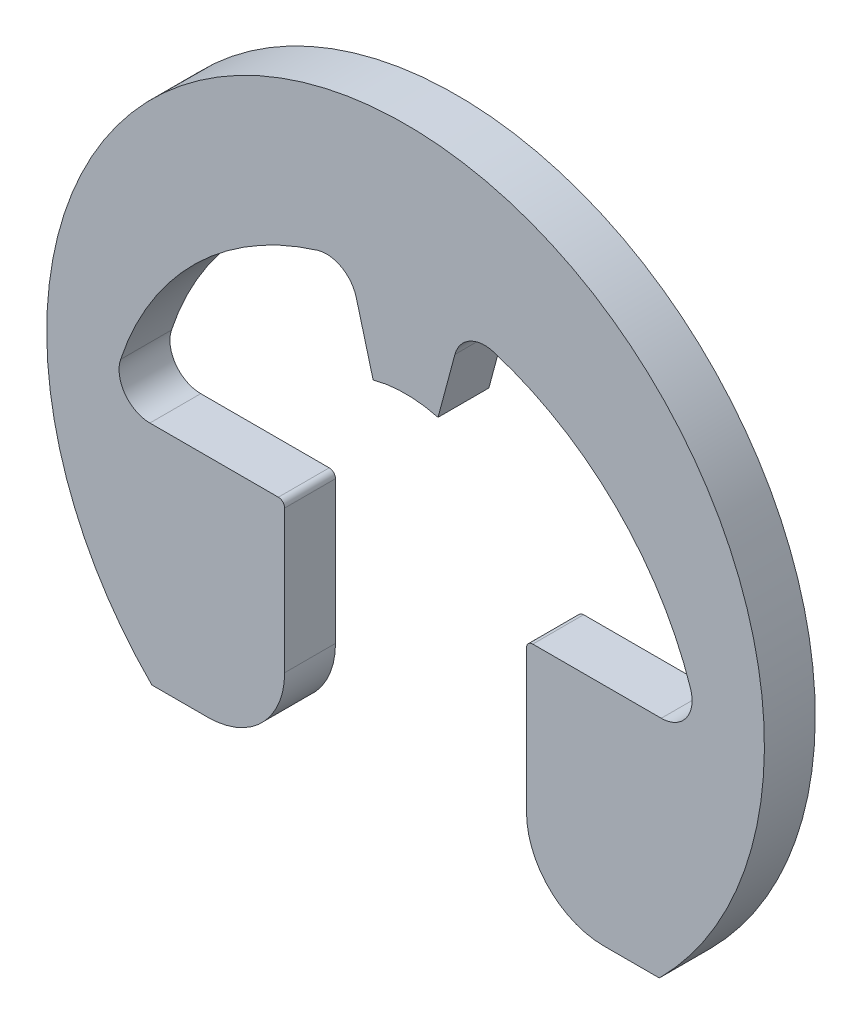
ISO-10303-21;
HEADER;
FILE_DESCRIPTION(('STEP AP214'),'2;1');
FILE_NAME('part.step','',(''),(''),'','','');
FILE_SCHEMA(('AUTOMOTIVE_DESIGN { 1 0 10303 214 1 1 1 1 }'));
ENDSEC;
DATA;
#1=APPLICATION_CONTEXT('core data for automotive mechanical design processes');
#2=APPLICATION_PROTOCOL_DEFINITION('international standard','automotive_design',2000,#1);
#3=PRODUCT_CONTEXT('',#1,'mechanical');
#4=PRODUCT('Part','Part','',(#3));
#5=PRODUCT_RELATED_PRODUCT_CATEGORY('part','',(#4));
#6=PRODUCT_DEFINITION_FORMATION('','',#4);
#7=PRODUCT_DEFINITION_CONTEXT('part definition',#1,'design');
#8=PRODUCT_DEFINITION('design','',#6,#7);
#9=PRODUCT_DEFINITION_SHAPE('','',#8);
#10=(LENGTH_UNIT() NAMED_UNIT(*) SI_UNIT(.MILLI.,.METRE.));
#11=(NAMED_UNIT(*) PLANE_ANGLE_UNIT() SI_UNIT($,.RADIAN.));
#12=(NAMED_UNIT(*) SI_UNIT($,.STERADIAN.) SOLID_ANGLE_UNIT());
#13=UNCERTAINTY_MEASURE_WITH_UNIT(LENGTH_MEASURE(1.E-05),#10,'distance_accuracy_value','');
#14=(GEOMETRIC_REPRESENTATION_CONTEXT(3) GLOBAL_UNCERTAINTY_ASSIGNED_CONTEXT((#13)) GLOBAL_UNIT_ASSIGNED_CONTEXT((#10,
#11,#12)) REPRESENTATION_CONTEXT('',''));
#15=CARTESIAN_POINT('',(0.,0.,0.));
#16=DIRECTION('',(0.,0.,1.));
#17=DIRECTION('',(1.,0.,0.));
#18=AXIS2_PLACEMENT_3D('',#15,#16,#17);
#19=CARTESIAN_POINT('',(-1.91596283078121,0.0224674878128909,-0.381));
#20=DIRECTION('',(0.,0.,1.));
#21=DIRECTION('',(1.,0.,0.));
#22=AXIS2_PLACEMENT_3D('',#19,#20,#21);
#23=CYLINDRICAL_SURFACE('',#22,0.230877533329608);
#24=CARTESIAN_POINT('',(-1.91596283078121,0.0224674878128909,0.));
#25=DIRECTION('',(0.,0.,-1.));
#26=DIRECTION('',(1.,0.,0.));
#27=AXIS2_PLACEMENT_3D('',#24,#25,#26);
#28=CIRCLE('',#27,0.230877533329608);
#29=CARTESIAN_POINT('',(-1.91596283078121,-0.208410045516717,0.));
#30=VERTEX_POINT('',#29);
#31=CARTESIAN_POINT('',(-2.13524840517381,0.0947050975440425,0.));
#32=VERTEX_POINT('',#31);
#33=EDGE_CURVE('E208',#30,#32,#28,.T.);
#34=ORIENTED_EDGE('',*,*,#33,.F.);
#35=DIRECTION('',(0.,0.,1.));
#36=VECTOR('',#35,1.);
#37=CARTESIAN_POINT('',(-1.91596283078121,-0.208410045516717,-0.381));
#38=LINE('',#37,#36);
#39=CARTESIAN_POINT('',(-1.91596283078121,-0.208410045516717,-0.381));
#40=VERTEX_POINT('',#39);
#41=EDGE_CURVE('E11',#40,#30,#38,.T.);
#42=ORIENTED_EDGE('',*,*,#41,.F.);
#43=CARTESIAN_POINT('',(-1.91596283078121,0.0224674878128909,-0.381));
#44=DIRECTION('',(0.,0.,-1.));
#45=DIRECTION('',(1.,0.,0.));
#46=AXIS2_PLACEMENT_3D('',#43,#44,#45);
#47=CIRCLE('',#46,0.230877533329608);
#48=CARTESIAN_POINT('',(-2.13524840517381,0.0947050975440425,-0.381));
#49=VERTEX_POINT('',#48);
#50=EDGE_CURVE('E264',#40,#49,#47,.T.);
#51=ORIENTED_EDGE('',*,*,#50,.T.);
#52=DIRECTION('',(0.,0.,1.));
#53=VECTOR('',#52,1.);
#54=CARTESIAN_POINT('',(-2.13524840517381,0.0947050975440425,-0.381));
#55=LINE('',#54,#53);
#56=EDGE_CURVE('E42',#49,#32,#55,.T.);
#57=ORIENTED_EDGE('',*,*,#56,.T.);
#58=EDGE_LOOP('',(#34,#42,#51,#57));
#59=FACE_BOUND('',#58,.T.);
#60=ADVANCED_FACE('F39',(#59),#23,.F.);
#61=CARTESIAN_POINT('',(-0.953165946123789,-0.208410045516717,-0.381));
#62=DIRECTION('',(0.,1.,0.));
#63=DIRECTION('',(-1.,0.,0.));
#64=AXIS2_PLACEMENT_3D('',#61,#62,#63);
#65=PLANE('',#64);
#66=DIRECTION('',(-1.,0.,0.));
#67=VECTOR('',#66,1.);
#68=CARTESIAN_POINT('',(-0.953165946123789,-0.208410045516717,0.));
#69=LINE('',#68,#67);
#70=CARTESIAN_POINT('',(-0.953165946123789,-0.208410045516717,0.));
#71=VERTEX_POINT('',#70);
#72=EDGE_CURVE('E262',#71,#30,#69,.T.);
#73=ORIENTED_EDGE('',*,*,#72,.F.);
#74=DIRECTION('',(0.,0.,1.));
#75=VECTOR('',#74,1.);
#76=CARTESIAN_POINT('',(-0.953165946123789,-0.208410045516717,-0.381));
#77=LINE('',#76,#75);
#78=CARTESIAN_POINT('',(-0.953165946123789,-0.208410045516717,-0.381));
#79=VERTEX_POINT('',#78);
#80=EDGE_CURVE('E48',#79,#71,#77,.T.);
#81=ORIENTED_EDGE('',*,*,#80,.F.);
#82=DIRECTION('',(-1.,0.,0.));
#83=VECTOR('',#82,1.);
#84=CARTESIAN_POINT('',(-0.953165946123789,-0.208410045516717,-0.381));
#85=LINE('',#84,#83);
#86=EDGE_CURVE('E198',#79,#40,#85,.T.);
#87=ORIENTED_EDGE('',*,*,#86,.T.);
#88=ORIENTED_EDGE('',*,*,#41,.T.);
#89=EDGE_LOOP('',(#73,#81,#87,#88));
#90=FACE_BOUND('',#89,.T.);
#91=ADVANCED_FACE('F300',(#90),#65,.T.);
#92=CARTESIAN_POINT('',(-0.953165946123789,-0.255400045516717,-0.381));
#93=DIRECTION('',(0.,0.,1.));
#94=DIRECTION('',(1.,0.,0.));
#95=AXIS2_PLACEMENT_3D('',#92,#93,#94);
#96=CYLINDRICAL_SURFACE('',#95,0.0469900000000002);
#97=CARTESIAN_POINT('',(-0.953165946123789,-0.255400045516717,0.));
#98=DIRECTION('',(0.,0.,1.));
#99=DIRECTION('',(1.,0.,0.));
#100=AXIS2_PLACEMENT_3D('',#97,#98,#99);
#101=CIRCLE('',#100,0.0469900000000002);
#102=CARTESIAN_POINT('',(-0.906175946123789,-0.255400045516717,0.));
#103=VERTEX_POINT('',#102);
#104=EDGE_CURVE('E185',#103,#71,#101,.T.);
#105=ORIENTED_EDGE('',*,*,#104,.F.);
#106=DIRECTION('',(0.,0.,1.));
#107=VECTOR('',#106,1.);
#108=CARTESIAN_POINT('',(-0.906175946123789,-0.255400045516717,-0.381));
#109=LINE('',#108,#107);
#110=CARTESIAN_POINT('',(-0.906175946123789,-0.255400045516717,-0.381));
#111=VERTEX_POINT('',#110);
#112=EDGE_CURVE('E180',#111,#103,#109,.T.);
#113=ORIENTED_EDGE('',*,*,#112,.F.);
#114=CARTESIAN_POINT('',(-0.953165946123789,-0.255400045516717,-0.381));
#115=DIRECTION('',(0.,0.,1.));
#116=DIRECTION('',(1.,0.,0.));
#117=AXIS2_PLACEMENT_3D('',#114,#115,#116);
#118=CIRCLE('',#117,0.0469900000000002);
#119=EDGE_CURVE('E183',#111,#79,#118,.T.);
#120=ORIENTED_EDGE('',*,*,#119,.T.);
#121=ORIENTED_EDGE('',*,*,#80,.T.);
#122=EDGE_LOOP('',(#105,#113,#120,#121));
#123=FACE_BOUND('',#122,.T.);
#124=ADVANCED_FACE('F182',(#123),#96,.T.);
#125=CARTESIAN_POINT('',(-0.906175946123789,-0.255400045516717,-0.381));
#126=DIRECTION('',(1.,0.,0.));
#127=DIRECTION('',(0.,1.,0.));
#128=AXIS2_PLACEMENT_3D('',#125,#126,#127);
#129=PLANE('',#128);
#130=DIRECTION('',(0.,1.,0.));
#131=VECTOR('',#130,1.);
#132=CARTESIAN_POINT('',(-0.906175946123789,-0.255400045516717,0.));
#133=LINE('',#132,#131);
#134=CARTESIAN_POINT('',(-0.906175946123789,-1.32412594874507,0.));
#135=VERTEX_POINT('',#134);
#136=EDGE_CURVE('E259',#135,#103,#133,.T.);
#137=ORIENTED_EDGE('',*,*,#136,.F.);
#138=DIRECTION('',(0.,0.,1.));
#139=VECTOR('',#138,1.);
#140=CARTESIAN_POINT('',(-0.906175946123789,-1.32412594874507,-0.381));
#141=LINE('',#140,#139);
#142=CARTESIAN_POINT('',(-0.906175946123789,-1.32412594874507,-0.381));
#143=VERTEX_POINT('',#142);
#144=EDGE_CURVE('E190',#143,#135,#141,.T.);
#145=ORIENTED_EDGE('',*,*,#144,.F.);
#146=DIRECTION('',(0.,1.,0.));
#147=VECTOR('',#146,1.);
#148=CARTESIAN_POINT('',(-0.906175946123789,-0.255400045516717,-0.381));
#149=LINE('',#148,#147);
#150=EDGE_CURVE('E196',#143,#111,#149,.T.);
#151=ORIENTED_EDGE('',*,*,#150,.T.);
#152=ORIENTED_EDGE('',*,*,#112,.T.);
#153=EDGE_LOOP('',(#137,#145,#151,#152));
#154=FACE_BOUND('',#153,.T.);
#155=ADVANCED_FACE('F200',(#154),#129,.T.);
#156=CARTESIAN_POINT('',(-1.48336977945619,-1.32412594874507,-0.381));
#157=DIRECTION('',(0.,0.,1.));
#158=DIRECTION('',(1.,0.,0.));
#159=AXIS2_PLACEMENT_3D('',#156,#157,#158);
#160=CYLINDRICAL_SURFACE('',#159,0.577193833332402);
#161=CARTESIAN_POINT('',(-1.48336977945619,-1.32412594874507,0.));
#162=DIRECTION('',(0.,0.,1.));
#163=DIRECTION('',(1.,0.,0.));
#164=AXIS2_PLACEMENT_3D('',#161,#162,#163);
#165=CIRCLE('',#164,0.577193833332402);
#166=CARTESIAN_POINT('',(-1.48336977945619,-1.90131978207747,0.));
#167=VERTEX_POINT('',#166);
#168=EDGE_CURVE('E256',#167,#135,#165,.T.);
#169=ORIENTED_EDGE('',*,*,#168,.F.);
#170=DIRECTION('',(0.,0.,1.));
#171=VECTOR('',#170,1.);
#172=CARTESIAN_POINT('',(-1.48336977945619,-1.90131978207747,-0.381));
#173=LINE('',#172,#171);
#174=CARTESIAN_POINT('',(-1.48336977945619,-1.90131978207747,-0.381));
#175=VERTEX_POINT('',#174);
#176=EDGE_CURVE('E268',#175,#167,#173,.T.);
#177=ORIENTED_EDGE('',*,*,#176,.F.);
#178=CARTESIAN_POINT('',(-1.48336977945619,-1.32412594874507,-0.381));
#179=DIRECTION('',(0.,0.,1.));
#180=DIRECTION('',(1.,0.,0.));
#181=AXIS2_PLACEMENT_3D('',#178,#179,#180);
#182=CIRCLE('',#181,0.577193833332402);
#183=EDGE_CURVE('E201',#175,#143,#182,.T.);
#184=ORIENTED_EDGE('',*,*,#183,.T.);
#185=ORIENTED_EDGE('',*,*,#144,.T.);
#186=EDGE_LOOP('',(#169,#177,#184,#185));
#187=FACE_BOUND('',#186,.T.);
#188=ADVANCED_FACE('F313',(#187),#160,.T.);
#189=CARTESIAN_POINT('',(-1.48336977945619,-1.90131978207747,-0.381));
#190=DIRECTION('',(0.,-1.,0.));
#191=DIRECTION('',(1.,0.,0.));
#192=AXIS2_PLACEMENT_3D('',#189,#190,#191);
#193=PLANE('',#192);
#194=DIRECTION('',(1.,0.,0.));
#195=VECTOR('',#194,1.);
#196=CARTESIAN_POINT('',(-1.48336977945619,-1.90131978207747,0.));
#197=LINE('',#196,#195);
#198=CARTESIAN_POINT('',(-1.90131978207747,-1.90131978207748,0.));
#199=VERTEX_POINT('',#198);
#200=EDGE_CURVE('E253',#199,#167,#197,.T.);
#201=ORIENTED_EDGE('',*,*,#200,.F.);
#202=DIRECTION('',(0.,0.,1.));
#203=VECTOR('',#202,1.);
#204=CARTESIAN_POINT('',(-1.90131978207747,-1.90131978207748,-0.381));
#205=LINE('',#204,#203);
#206=CARTESIAN_POINT('',(-1.90131978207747,-1.90131978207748,-0.381));
#207=VERTEX_POINT('',#206);
#208=EDGE_CURVE('E270',#207,#199,#205,.T.);
#209=ORIENTED_EDGE('',*,*,#208,.F.);
#210=DIRECTION('',(1.,0.,0.));
#211=VECTOR('',#210,1.);
#212=CARTESIAN_POINT('',(-1.48336977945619,-1.90131978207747,-0.381));
#213=LINE('',#212,#211);
#214=EDGE_CURVE('E203',#207,#175,#213,.T.);
#215=ORIENTED_EDGE('',*,*,#214,.T.);
#216=ORIENTED_EDGE('',*,*,#176,.T.);
#217=EDGE_LOOP('',(#201,#209,#215,#216));
#218=FACE_BOUND('',#217,.T.);
#219=ADVANCED_FACE('F316',(#218),#193,.T.);
#220=CARTESIAN_POINT('',(0.,0.,-0.381));
#221=DIRECTION('',(0.,0.,1.));
#222=DIRECTION('',(1.,0.,0.));
#223=AXIS2_PLACEMENT_3D('',#220,#221,#222);
#224=CYLINDRICAL_SURFACE('',#223,2.68887222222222);
#225=CARTESIAN_POINT('',(0.,0.,0.));
#226=DIRECTION('',(0.,0.,1.));
#227=DIRECTION('',(1.,0.,0.));
#228=AXIS2_PLACEMENT_3D('',#225,#226,#227);
#229=CIRCLE('',#228,2.68887222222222);
#230=CARTESIAN_POINT('',(1.90131978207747,-1.90131978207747,0.));
#231=VERTEX_POINT('',#230);
#232=EDGE_CURVE('E250',#231,#199,#229,.T.);
#233=ORIENTED_EDGE('',*,*,#232,.F.);
#234=DIRECTION('',(0.,0.,1.));
#235=VECTOR('',#234,1.);
#236=CARTESIAN_POINT('',(1.90131978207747,-1.90131978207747,-0.381));
#237=LINE('',#236,#235);
#238=CARTESIAN_POINT('',(1.90131978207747,-1.90131978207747,-0.381));
#239=VERTEX_POINT('',#238);
#240=EDGE_CURVE('E272',#239,#231,#237,.T.);
#241=ORIENTED_EDGE('',*,*,#240,.F.);
#242=CARTESIAN_POINT('',(0.,0.,-0.381));
#243=DIRECTION('',(0.,0.,1.));
#244=DIRECTION('',(1.,0.,0.));
#245=AXIS2_PLACEMENT_3D('',#242,#243,#244);
#246=CIRCLE('',#245,2.68887222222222);
#247=EDGE_CURVE('E555',#239,#207,#246,.T.);
#248=ORIENTED_EDGE('',*,*,#247,.T.);
#249=ORIENTED_EDGE('',*,*,#208,.T.);
#250=EDGE_LOOP('',(#233,#241,#248,#249));
#251=FACE_BOUND('',#250,.T.);
#252=ADVANCED_FACE('F320',(#251),#224,.T.);
#253=CARTESIAN_POINT('',(1.90131978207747,-1.90131978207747,-0.381));
#254=DIRECTION('',(0.,-1.,0.));
#255=DIRECTION('',(0.,0.,-1.));
#256=AXIS2_PLACEMENT_3D('',#253,#254,#255);
#257=PLANE('',#256);
#258=DIRECTION('',(1.,0.,0.));
#259=VECTOR('',#258,1.);
#260=CARTESIAN_POINT('',(1.90131978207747,-1.90131978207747,0.));
#261=LINE('',#260,#259);
#262=CARTESIAN_POINT('',(1.48336977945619,-1.90131978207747,0.));
#263=VERTEX_POINT('',#262);
#264=EDGE_CURVE('E247',#263,#231,#261,.T.);
#265=ORIENTED_EDGE('',*,*,#264,.F.);
#266=DIRECTION('',(0.,0.,1.));
#267=VECTOR('',#266,1.);
#268=CARTESIAN_POINT('',(1.48336977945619,-1.90131978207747,-0.381));
#269=LINE('',#268,#267);
#270=CARTESIAN_POINT('',(1.48336977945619,-1.90131978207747,-0.381));
#271=VERTEX_POINT('',#270);
#272=EDGE_CURVE('E274',#271,#263,#269,.T.);
#273=ORIENTED_EDGE('',*,*,#272,.F.);
#274=DIRECTION('',(1.,0.,0.));
#275=VECTOR('',#274,1.);
#276=CARTESIAN_POINT('',(1.90131978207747,-1.90131978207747,-0.381));
#277=LINE('',#276,#275);
#278=EDGE_CURVE('E548',#271,#239,#277,.T.);
#279=ORIENTED_EDGE('',*,*,#278,.T.);
#280=ORIENTED_EDGE('',*,*,#240,.T.);
#281=EDGE_LOOP('',(#265,#273,#279,#280));
#282=FACE_BOUND('',#281,.T.);
#283=ADVANCED_FACE('F324',(#282),#257,.T.);
#284=CARTESIAN_POINT('',(1.48336977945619,-1.32412594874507,-0.381));
#285=DIRECTION('',(0.,0.,1.));
#286=DIRECTION('',(1.,0.,0.));
#287=AXIS2_PLACEMENT_3D('',#284,#285,#286);
#288=CYLINDRICAL_SURFACE('',#287,0.577193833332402);
#289=CARTESIAN_POINT('',(1.48336977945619,-1.32412594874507,0.));
#290=DIRECTION('',(0.,0.,1.));
#291=DIRECTION('',(1.,0.,0.));
#292=AXIS2_PLACEMENT_3D('',#289,#290,#291);
#293=CIRCLE('',#292,0.577193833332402);
#294=CARTESIAN_POINT('',(0.90617594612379,-1.32412594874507,0.));
#295=VERTEX_POINT('',#294);
#296=EDGE_CURVE('E244',#295,#263,#293,.T.);
#297=ORIENTED_EDGE('',*,*,#296,.F.);
#298=DIRECTION('',(0.,0.,1.));
#299=VECTOR('',#298,1.);
#300=CARTESIAN_POINT('',(0.90617594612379,-1.32412594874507,-0.381));
#301=LINE('',#300,#299);
#302=CARTESIAN_POINT('',(0.90617594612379,-1.32412594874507,-0.381));
#303=VERTEX_POINT('',#302);
#304=EDGE_CURVE('E276',#303,#295,#301,.T.);
#305=ORIENTED_EDGE('',*,*,#304,.F.);
#306=CARTESIAN_POINT('',(1.48336977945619,-1.32412594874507,-0.381));
#307=DIRECTION('',(0.,0.,1.));
#308=DIRECTION('',(1.,0.,0.));
#309=AXIS2_PLACEMENT_3D('',#306,#307,#308);
#310=CIRCLE('',#309,0.577193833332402);
#311=EDGE_CURVE('E544',#303,#271,#310,.T.);
#312=ORIENTED_EDGE('',*,*,#311,.T.);
#313=ORIENTED_EDGE('',*,*,#272,.T.);
#314=EDGE_LOOP('',(#297,#305,#312,#313));
#315=FACE_BOUND('',#314,.T.);
#316=ADVANCED_FACE('F328',(#315),#288,.T.);
#317=CARTESIAN_POINT('',(0.906175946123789,-0.255400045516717,-0.381));
#318=DIRECTION('',(-1.,0.,0.));
#319=DIRECTION('',(0.,-1.,0.));
#320=AXIS2_PLACEMENT_3D('',#317,#318,#319);
#321=PLANE('',#320);
#322=DIRECTION('',(0.,-1.,0.));
#323=VECTOR('',#322,1.);
#324=CARTESIAN_POINT('',(0.906175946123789,-0.255400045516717,0.));
#325=LINE('',#324,#323);
#326=CARTESIAN_POINT('',(0.906175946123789,-0.255400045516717,0.));
#327=VERTEX_POINT('',#326);
#328=EDGE_CURVE('E241',#327,#295,#325,.T.);
#329=ORIENTED_EDGE('',*,*,#328,.F.);
#330=DIRECTION('',(0.,0.,1.));
#331=VECTOR('',#330,1.);
#332=CARTESIAN_POINT('',(0.906175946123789,-0.255400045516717,-0.381));
#333=LINE('',#332,#331);
#334=CARTESIAN_POINT('',(0.906175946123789,-0.255400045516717,-0.381));
#335=VERTEX_POINT('',#334);
#336=EDGE_CURVE('E278',#335,#327,#333,.T.);
#337=ORIENTED_EDGE('',*,*,#336,.F.);
#338=DIRECTION('',(0.,-1.,0.));
#339=VECTOR('',#338,1.);
#340=CARTESIAN_POINT('',(0.906175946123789,-0.255400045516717,-0.381));
#341=LINE('',#340,#339);
#342=EDGE_CURVE('E560',#335,#303,#341,.T.);
#343=ORIENTED_EDGE('',*,*,#342,.T.);
#344=ORIENTED_EDGE('',*,*,#304,.T.);
#345=EDGE_LOOP('',(#329,#337,#343,#344));
#346=FACE_BOUND('',#345,.T.);
#347=ADVANCED_FACE('F332',(#346),#321,.T.);
#348=CARTESIAN_POINT('',(0.953165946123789,-0.255400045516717,-0.381));
#349=DIRECTION('',(0.,0.,1.));
#350=DIRECTION('',(1.,0.,0.));
#351=AXIS2_PLACEMENT_3D('',#348,#349,#350);
#352=CYLINDRICAL_SURFACE('',#351,0.0469900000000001);
#353=CARTESIAN_POINT('',(0.953165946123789,-0.255400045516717,0.));
#354=DIRECTION('',(0.,0.,1.));
#355=DIRECTION('',(1.,0.,0.));
#356=AXIS2_PLACEMENT_3D('',#353,#354,#355);
#357=CIRCLE('',#356,0.0469900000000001);
#358=CARTESIAN_POINT('',(0.953165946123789,-0.208410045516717,0.));
#359=VERTEX_POINT('',#358);
#360=EDGE_CURVE('E238',#359,#327,#357,.T.);
#361=ORIENTED_EDGE('',*,*,#360,.F.);
#362=DIRECTION('',(0.,0.,1.));
#363=VECTOR('',#362,1.);
#364=CARTESIAN_POINT('',(0.953165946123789,-0.208410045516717,-0.381));
#365=LINE('',#364,#363);
#366=CARTESIAN_POINT('',(0.953165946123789,-0.208410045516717,-0.381));
#367=VERTEX_POINT('',#366);
#368=EDGE_CURVE('E280',#367,#359,#365,.T.);
#369=ORIENTED_EDGE('',*,*,#368,.F.);
#370=CARTESIAN_POINT('',(0.953165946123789,-0.255400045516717,-0.381));
#371=DIRECTION('',(0.,0.,1.));
#372=DIRECTION('',(1.,0.,0.));
#373=AXIS2_PLACEMENT_3D('',#370,#371,#372);
#374=CIRCLE('',#373,0.0469900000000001);
#375=EDGE_CURVE('E537',#367,#335,#374,.T.);
#376=ORIENTED_EDGE('',*,*,#375,.T.);
#377=ORIENTED_EDGE('',*,*,#336,.T.);
#378=EDGE_LOOP('',(#361,#369,#376,#377));
#379=FACE_BOUND('',#378,.T.);
#380=ADVANCED_FACE('F336',(#379),#352,.T.);
#381=CARTESIAN_POINT('',(0.953165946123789,-0.208410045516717,-0.381));
#382=DIRECTION('',(0.,1.,0.));
#383=DIRECTION('',(-1.,0.,0.));
#384=AXIS2_PLACEMENT_3D('',#381,#382,#383);
#385=PLANE('',#384);
#386=DIRECTION('',(-1.,0.,0.));
#387=VECTOR('',#386,1.);
#388=CARTESIAN_POINT('',(0.953165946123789,-0.208410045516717,0.));
#389=LINE('',#388,#387);
#390=CARTESIAN_POINT('',(1.91596283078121,-0.208410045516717,0.));
#391=VERTEX_POINT('',#390);
#392=EDGE_CURVE('E235',#391,#359,#389,.T.);
#393=ORIENTED_EDGE('',*,*,#392,.F.);
#394=DIRECTION('',(0.,0.,1.));
#395=VECTOR('',#394,1.);
#396=CARTESIAN_POINT('',(1.91596283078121,-0.208410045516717,-0.381));
#397=LINE('',#396,#395);
#398=CARTESIAN_POINT('',(1.91596283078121,-0.208410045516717,-0.381));
#399=VERTEX_POINT('',#398);
#400=EDGE_CURVE('E282',#399,#391,#397,.T.);
#401=ORIENTED_EDGE('',*,*,#400,.F.);
#402=DIRECTION('',(-1.,0.,0.));
#403=VECTOR('',#402,1.);
#404=CARTESIAN_POINT('',(0.953165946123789,-0.208410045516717,-0.381));
#405=LINE('',#404,#403);
#406=EDGE_CURVE('E533',#399,#367,#405,.T.);
#407=ORIENTED_EDGE('',*,*,#406,.T.);
#408=ORIENTED_EDGE('',*,*,#368,.T.);
#409=EDGE_LOOP('',(#393,#401,#407,#408));
#410=FACE_BOUND('',#409,.T.);
#411=ADVANCED_FACE('F340',(#410),#385,.T.);
#412=CARTESIAN_POINT('',(1.91596283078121,0.0224674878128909,-0.381));
#413=DIRECTION('',(0.,0.,1.));
#414=DIRECTION('',(1.,0.,0.));
#415=AXIS2_PLACEMENT_3D('',#412,#413,#414);
#416=CYLINDRICAL_SURFACE('',#415,0.230877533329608);
#417=CARTESIAN_POINT('',(1.91596283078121,0.0224674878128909,0.));
#418=DIRECTION('',(0.,0.,-1.));
#419=DIRECTION('',(1.,0.,0.));
#420=AXIS2_PLACEMENT_3D('',#417,#418,#419);
#421=CIRCLE('',#420,0.230877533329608);
#422=CARTESIAN_POINT('',(2.13524840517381,0.0947050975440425,0.));
#423=VERTEX_POINT('',#422);
#424=EDGE_CURVE('E232',#423,#391,#421,.T.);
#425=ORIENTED_EDGE('',*,*,#424,.F.);
#426=DIRECTION('',(0.,0.,1.));
#427=VECTOR('',#426,1.);
#428=CARTESIAN_POINT('',(2.13524840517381,0.0947050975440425,-0.381));
#429=LINE('',#428,#427);
#430=CARTESIAN_POINT('',(2.13524840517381,0.0947050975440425,-0.381));
#431=VERTEX_POINT('',#430);
#432=EDGE_CURVE('E284',#431,#423,#429,.T.);
#433=ORIENTED_EDGE('',*,*,#432,.F.);
#434=CARTESIAN_POINT('',(1.91596283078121,0.0224674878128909,-0.381));
#435=DIRECTION('',(0.,0.,-1.));
#436=DIRECTION('',(1.,0.,0.));
#437=AXIS2_PLACEMENT_3D('',#434,#435,#436);
#438=CIRCLE('',#437,0.230877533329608);
#439=EDGE_CURVE('E564',#431,#399,#438,.T.);
#440=ORIENTED_EDGE('',*,*,#439,.T.);
#441=ORIENTED_EDGE('',*,*,#400,.T.);
#442=EDGE_LOOP('',(#425,#433,#440,#441));
#443=FACE_BOUND('',#442,.T.);
#444=ADVANCED_FACE('F344',(#443),#416,.F.);
#445=CARTESIAN_POINT('',(0.,-0.608693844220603,-0.381));
#446=DIRECTION('',(0.,0.,1.));
#447=DIRECTION('',(1.,0.,0.));
#448=AXIS2_PLACEMENT_3D('',#445,#446,#447);
#449=CYLINDRICAL_SURFACE('',#448,2.2481227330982);
#450=CARTESIAN_POINT('',(0.,-0.608693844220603,0.));
#451=DIRECTION('',(0.,0.,-1.));
#452=DIRECTION('',(-1.,0.,0.));
#453=AXIS2_PLACEMENT_3D('',#450,#451,#452);
#454=CIRCLE('',#453,2.2481227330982);
#455=CARTESIAN_POINT('',(0.66041689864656,1.54023736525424,0.));
#456=VERTEX_POINT('',#455);
#457=EDGE_CURVE('E229',#456,#423,#454,.T.);
#458=ORIENTED_EDGE('',*,*,#457,.F.);
#459=DIRECTION('',(0.,0.,1.));
#460=VECTOR('',#459,1.);
#461=CARTESIAN_POINT('',(0.66041689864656,1.54023736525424,-0.381));
#462=LINE('',#461,#460);
#463=CARTESIAN_POINT('',(0.66041689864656,1.54023736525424,-0.381));
#464=VERTEX_POINT('',#463);
#465=EDGE_CURVE('E286',#464,#456,#462,.T.);
#466=ORIENTED_EDGE('',*,*,#465,.F.);
#467=CARTESIAN_POINT('',(0.,-0.608693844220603,-0.381));
#468=DIRECTION('',(0.,0.,-1.));
#469=DIRECTION('',(-1.,0.,0.));
#470=AXIS2_PLACEMENT_3D('',#467,#468,#469);
#471=CIRCLE('',#470,2.2481227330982);
#472=EDGE_CURVE('E526',#464,#431,#471,.T.);
#473=ORIENTED_EDGE('',*,*,#472,.T.);
#474=ORIENTED_EDGE('',*,*,#432,.T.);
#475=EDGE_LOOP('',(#458,#466,#473,#474));
#476=FACE_BOUND('',#475,.T.);
#477=ADVANCED_FACE('F348',(#476),#449,.F.);
#478=CARTESIAN_POINT('',(0.592593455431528,1.31954659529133,-0.381));
#479=DIRECTION('',(0.,0.,1.));
#480=DIRECTION('',(1.,0.,0.));
#481=AXIS2_PLACEMENT_3D('',#478,#479,#480);
#482=CYLINDRICAL_SURFACE('',#481,0.230877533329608);
#483=CARTESIAN_POINT('',(0.592593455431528,1.31954659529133,0.));
#484=DIRECTION('',(0.,0.,-1.));
#485=DIRECTION('',(1.,0.,0.));
#486=AXIS2_PLACEMENT_3D('',#483,#484,#485);
#487=CIRCLE('',#486,0.230877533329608);
#488=CARTESIAN_POINT('',(0.369582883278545,1.37930209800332,0.));
#489=VERTEX_POINT('',#488);
#490=EDGE_CURVE('E226',#489,#456,#487,.T.);
#491=ORIENTED_EDGE('',*,*,#490,.F.);
#492=DIRECTION('',(0.,0.,1.));
#493=VECTOR('',#492,1.);
#494=CARTESIAN_POINT('',(0.369582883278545,1.37930209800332,-0.381));
#495=LINE('',#494,#493);
#496=CARTESIAN_POINT('',(0.369582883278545,1.37930209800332,-0.381));
#497=VERTEX_POINT('',#496);
#498=EDGE_CURVE('E288',#497,#489,#495,.T.);
#499=ORIENTED_EDGE('',*,*,#498,.F.);
#500=CARTESIAN_POINT('',(0.592593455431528,1.31954659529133,-0.381));
#501=DIRECTION('',(0.,0.,-1.));
#502=DIRECTION('',(1.,0.,0.));
#503=AXIS2_PLACEMENT_3D('',#500,#501,#502);
#504=CIRCLE('',#503,0.230877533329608);
#505=EDGE_CURVE('E522',#497,#464,#504,.T.);
#506=ORIENTED_EDGE('',*,*,#505,.T.);
#507=ORIENTED_EDGE('',*,*,#465,.T.);
#508=EDGE_LOOP('',(#491,#499,#506,#507));
#509=FACE_BOUND('',#508,.T.);
#510=ADVANCED_FACE('F352',(#509),#482,.F.);
#511=CARTESIAN_POINT('',(0.369582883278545,1.37930209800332,-0.381));
#512=DIRECTION('',(0.965925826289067,-0.258819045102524,0.));
#513=DIRECTION('',(0.258819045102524,0.965925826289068,0.));
#514=AXIS2_PLACEMENT_3D('',#511,#512,#513);
#515=PLANE('',#514);
#516=DIRECTION('',(0.258819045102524,0.965925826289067,0.));
#517=VECTOR('',#516,1.);
#518=CARTESIAN_POINT('',(0.369582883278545,1.37930209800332,0.));
#519=LINE('',#518,#517);
#520=CARTESIAN_POINT('',(0.243238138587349,0.907777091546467,0.));
#521=VERTEX_POINT('',#520);
#522=EDGE_CURVE('E223',#521,#489,#519,.T.);
#523=ORIENTED_EDGE('',*,*,#522,.F.);
#524=DIRECTION('',(0.,0.,1.));
#525=VECTOR('',#524,1.);
#526=CARTESIAN_POINT('',(0.243238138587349,0.907777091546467,-0.381));
#527=LINE('',#526,#525);
#528=CARTESIAN_POINT('',(0.243238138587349,0.907777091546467,-0.381));
#529=VERTEX_POINT('',#528);
#530=EDGE_CURVE('E290',#529,#521,#527,.T.);
#531=ORIENTED_EDGE('',*,*,#530,.F.);
#532=DIRECTION('',(0.258819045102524,0.965925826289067,0.));
#533=VECTOR('',#532,1.);
#534=CARTESIAN_POINT('',(0.369582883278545,1.37930209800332,-0.381));
#535=LINE('',#534,#533);
#536=EDGE_CURVE('E568',#529,#497,#535,.T.);
#537=ORIENTED_EDGE('',*,*,#536,.T.);
#538=ORIENTED_EDGE('',*,*,#498,.T.);
#539=EDGE_LOOP('',(#523,#531,#537,#538));
#540=FACE_BOUND('',#539,.T.);
#541=ADVANCED_FACE('F356',(#540),#515,.T.);
#542=CARTESIAN_POINT('',(0.,0.,-0.381));
#543=DIRECTION('',(0.,0.,1.));
#544=DIRECTION('',(1.,0.,0.));
#545=AXIS2_PLACEMENT_3D('',#542,#543,#544);
#546=CYLINDRICAL_SURFACE('',#545,0.9398);
#547=CARTESIAN_POINT('',(0.,0.,0.));
#548=DIRECTION('',(0.,0.,-1.));
#549=DIRECTION('',(-1.,0.,0.));
#550=AXIS2_PLACEMENT_3D('',#547,#548,#549);
#551=CIRCLE('',#550,0.9398);
#552=CARTESIAN_POINT('',(-0.243238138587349,0.907777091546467,0.));
#553=VERTEX_POINT('',#552);
#554=EDGE_CURVE('E220',#553,#521,#551,.T.);
#555=ORIENTED_EDGE('',*,*,#554,.F.);
#556=DIRECTION('',(0.,0.,1.));
#557=VECTOR('',#556,1.);
#558=CARTESIAN_POINT('',(-0.243238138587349,0.907777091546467,-0.381));
#559=LINE('',#558,#557);
#560=CARTESIAN_POINT('',(-0.243238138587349,0.907777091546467,-0.381));
#561=VERTEX_POINT('',#560);
#562=EDGE_CURVE('E292',#561,#553,#559,.T.);
#563=ORIENTED_EDGE('',*,*,#562,.F.);
#564=CARTESIAN_POINT('',(0.,0.,-0.381));
#565=DIRECTION('',(0.,0.,-1.));
#566=DIRECTION('',(-1.,0.,0.));
#567=AXIS2_PLACEMENT_3D('',#564,#565,#566);
#568=CIRCLE('',#567,0.9398);
#569=EDGE_CURVE('E515',#561,#529,#568,.T.);
#570=ORIENTED_EDGE('',*,*,#569,.T.);
#571=ORIENTED_EDGE('',*,*,#530,.T.);
#572=EDGE_LOOP('',(#555,#563,#570,#571));
#573=FACE_BOUND('',#572,.T.);
#574=ADVANCED_FACE('F360',(#573),#546,.F.);
#575=CARTESIAN_POINT('',(-0.369582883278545,1.37930209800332,-0.381));
#576=DIRECTION('',(-0.965925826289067,-0.258819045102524,0.));
#577=DIRECTION('',(0.258819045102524,-0.965925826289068,0.));
#578=AXIS2_PLACEMENT_3D('',#575,#576,#577);
#579=PLANE('',#578);
#580=DIRECTION('',(0.258819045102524,-0.965925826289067,0.));
#581=VECTOR('',#580,1.);
#582=CARTESIAN_POINT('',(-0.369582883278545,1.37930209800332,0.));
#583=LINE('',#582,#581);
#584=CARTESIAN_POINT('',(-0.369582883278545,1.37930209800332,0.));
#585=VERTEX_POINT('',#584);
#586=EDGE_CURVE('E217',#585,#553,#583,.T.);
#587=ORIENTED_EDGE('',*,*,#586,.F.);
#588=DIRECTION('',(0.,0.,1.));
#589=VECTOR('',#588,1.);
#590=CARTESIAN_POINT('',(-0.369582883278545,1.37930209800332,-0.381));
#591=LINE('',#590,#589);
#592=CARTESIAN_POINT('',(-0.369582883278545,1.37930209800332,-0.381));
#593=VERTEX_POINT('',#592);
#594=EDGE_CURVE('E294',#593,#585,#591,.T.);
#595=ORIENTED_EDGE('',*,*,#594,.F.);
#596=DIRECTION('',(0.258819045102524,-0.965925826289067,0.));
#597=VECTOR('',#596,1.);
#598=CARTESIAN_POINT('',(-0.369582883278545,1.37930209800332,-0.381));
#599=LINE('',#598,#597);
#600=EDGE_CURVE('E511',#593,#561,#599,.T.);
#601=ORIENTED_EDGE('',*,*,#600,.T.);
#602=ORIENTED_EDGE('',*,*,#562,.T.);
#603=EDGE_LOOP('',(#587,#595,#601,#602));
#604=FACE_BOUND('',#603,.T.);
#605=ADVANCED_FACE('F364',(#604),#579,.T.);
#606=CARTESIAN_POINT('',(-0.592593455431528,1.31954659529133,-0.381));
#607=DIRECTION('',(0.,0.,1.));
#608=DIRECTION('',(1.,0.,0.));
#609=AXIS2_PLACEMENT_3D('',#606,#607,#608);
#610=CYLINDRICAL_SURFACE('',#609,0.230877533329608);
#611=CARTESIAN_POINT('',(-0.592593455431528,1.31954659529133,0.));
#612=DIRECTION('',(0.,0.,-1.));
#613=DIRECTION('',(1.,0.,0.));
#614=AXIS2_PLACEMENT_3D('',#611,#612,#613);
#615=CIRCLE('',#614,0.230877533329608);
#616=CARTESIAN_POINT('',(-0.66041689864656,1.54023736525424,0.));
#617=VERTEX_POINT('',#616);
#618=EDGE_CURVE('E214',#617,#585,#615,.T.);
#619=ORIENTED_EDGE('',*,*,#618,.F.);
#620=DIRECTION('',(0.,0.,1.));
#621=VECTOR('',#620,1.);
#622=CARTESIAN_POINT('',(-0.66041689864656,1.54023736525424,-0.381));
#623=LINE('',#622,#621);
#624=CARTESIAN_POINT('',(-0.66041689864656,1.54023736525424,-0.381));
#625=VERTEX_POINT('',#624);
#626=EDGE_CURVE('E295',#625,#617,#623,.T.);
#627=ORIENTED_EDGE('',*,*,#626,.F.);
#628=CARTESIAN_POINT('',(-0.592593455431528,1.31954659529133,-0.381));
#629=DIRECTION('',(0.,0.,-1.));
#630=DIRECTION('',(1.,0.,0.));
#631=AXIS2_PLACEMENT_3D('',#628,#629,#630);
#632=CIRCLE('',#631,0.230877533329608);
#633=EDGE_CURVE('E572',#625,#593,#632,.T.);
#634=ORIENTED_EDGE('',*,*,#633,.T.);
#635=ORIENTED_EDGE('',*,*,#594,.T.);
#636=EDGE_LOOP('',(#619,#627,#634,#635));
#637=FACE_BOUND('',#636,.T.);
#638=ADVANCED_FACE('F368',(#637),#610,.F.);
#639=CARTESIAN_POINT('',(0.,-0.608693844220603,-0.381));
#640=DIRECTION('',(0.,0.,1.));
#641=DIRECTION('',(1.,0.,0.));
#642=AXIS2_PLACEMENT_3D('',#639,#640,#641);
#643=CYLINDRICAL_SURFACE('',#642,2.2481227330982);
#644=CARTESIAN_POINT('',(0.,-0.608693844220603,0.));
#645=DIRECTION('',(0.,0.,-1.));
#646=DIRECTION('',(-1.,0.,0.));
#647=AXIS2_PLACEMENT_3D('',#644,#645,#646);
#648=CIRCLE('',#647,2.2481227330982);
#649=EDGE_CURVE('E211',#32,#617,#648,.T.);
#650=ORIENTED_EDGE('',*,*,#649,.F.);
#651=ORIENTED_EDGE('',*,*,#56,.F.);
#652=CARTESIAN_POINT('',(0.,-0.608693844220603,-0.381));
#653=DIRECTION('',(0.,0.,-1.));
#654=DIRECTION('',(-1.,0.,0.));
#655=AXIS2_PLACEMENT_3D('',#652,#653,#654);
#656=CIRCLE('',#655,2.2481227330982);
#657=EDGE_CURVE('E574',#49,#625,#656,.T.);
#658=ORIENTED_EDGE('',*,*,#657,.T.);
#659=ORIENTED_EDGE('',*,*,#626,.T.);
#660=EDGE_LOOP('',(#650,#651,#658,#659));
#661=FACE_BOUND('',#660,.T.);
#662=ADVANCED_FACE('F297',(#661),#643,.F.);
#663=CARTESIAN_POINT('',(-1.91596283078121,0.0224674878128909,-0.381));
#664=DIRECTION('',(0.,0.,1.));
#665=DIRECTION('',(1.,0.,0.));
#666=AXIS2_PLACEMENT_3D('',#663,#664,#665);
#667=PLANE('',#666);
#668=ORIENTED_EDGE('',*,*,#50,.F.);
#669=ORIENTED_EDGE('',*,*,#86,.F.);
#670=ORIENTED_EDGE('',*,*,#119,.F.);
#671=ORIENTED_EDGE('',*,*,#150,.F.);
#672=ORIENTED_EDGE('',*,*,#183,.F.);
#673=ORIENTED_EDGE('',*,*,#214,.F.);
#674=ORIENTED_EDGE('',*,*,#247,.F.);
#675=ORIENTED_EDGE('',*,*,#278,.F.);
#676=ORIENTED_EDGE('',*,*,#311,.F.);
#677=ORIENTED_EDGE('',*,*,#342,.F.);
#678=ORIENTED_EDGE('',*,*,#375,.F.);
#679=ORIENTED_EDGE('',*,*,#406,.F.);
#680=ORIENTED_EDGE('',*,*,#439,.F.);
#681=ORIENTED_EDGE('',*,*,#472,.F.);
#682=ORIENTED_EDGE('',*,*,#505,.F.);
#683=ORIENTED_EDGE('',*,*,#536,.F.);
#684=ORIENTED_EDGE('',*,*,#569,.F.);
#685=ORIENTED_EDGE('',*,*,#600,.F.);
#686=ORIENTED_EDGE('',*,*,#633,.F.);
#687=ORIENTED_EDGE('',*,*,#657,.F.);
#688=EDGE_LOOP('',(#668,#669,#670,#671,#672,#673,#674,#675,#676,#677,#678,#679,#680,#681,#682,
#683,#684,#685,#686,#687));
#689=FACE_BOUND('',#688,.T.);
#690=ADVANCED_FACE('F194',(#689),#667,.F.);
#691=CARTESIAN_POINT('',(-1.91596283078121,0.0224674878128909,0.));
#692=DIRECTION('',(0.,0.,1.));
#693=DIRECTION('',(1.,0.,0.));
#694=AXIS2_PLACEMENT_3D('',#691,#692,#693);
#695=PLANE('',#694);
#696=ORIENTED_EDGE('',*,*,#33,.T.);
#697=ORIENTED_EDGE('',*,*,#649,.T.);
#698=ORIENTED_EDGE('',*,*,#618,.T.);
#699=ORIENTED_EDGE('',*,*,#586,.T.);
#700=ORIENTED_EDGE('',*,*,#554,.T.);
#701=ORIENTED_EDGE('',*,*,#522,.T.);
#702=ORIENTED_EDGE('',*,*,#490,.T.);
#703=ORIENTED_EDGE('',*,*,#457,.T.);
#704=ORIENTED_EDGE('',*,*,#424,.T.);
#705=ORIENTED_EDGE('',*,*,#392,.T.);
#706=ORIENTED_EDGE('',*,*,#360,.T.);
#707=ORIENTED_EDGE('',*,*,#328,.T.);
#708=ORIENTED_EDGE('',*,*,#296,.T.);
#709=ORIENTED_EDGE('',*,*,#264,.T.);
#710=ORIENTED_EDGE('',*,*,#232,.T.);
#711=ORIENTED_EDGE('',*,*,#200,.T.);
#712=ORIENTED_EDGE('',*,*,#168,.T.);
#713=ORIENTED_EDGE('',*,*,#136,.T.);
#714=ORIENTED_EDGE('',*,*,#104,.T.);
#715=ORIENTED_EDGE('',*,*,#72,.T.);
#716=EDGE_LOOP('',(#696,#697,#698,#699,#700,#701,#702,#703,#704,#705,#706,#707,#708,#709,#710,
#711,#712,#713,#714,#715));
#717=FACE_BOUND('',#716,.T.);
#718=ADVANCED_FACE('F299',(#717),#695,.T.);
#719=CLOSED_SHELL('',(#60,#91,#124,#155,#188,#219,#252,#283,#316,#347,#380,#411,#444,#477,#510,
#541,#574,#605,#638,#662,#690,#718));
#720=MANIFOLD_SOLID_BREP('B2',#719);
#721=ADVANCED_BREP_SHAPE_REPRESENTATION('',(#18,#720),#14);
#722=SHAPE_DEFINITION_REPRESENTATION(#9,#721);
ENDSEC;
END-ISO-10303-21;
